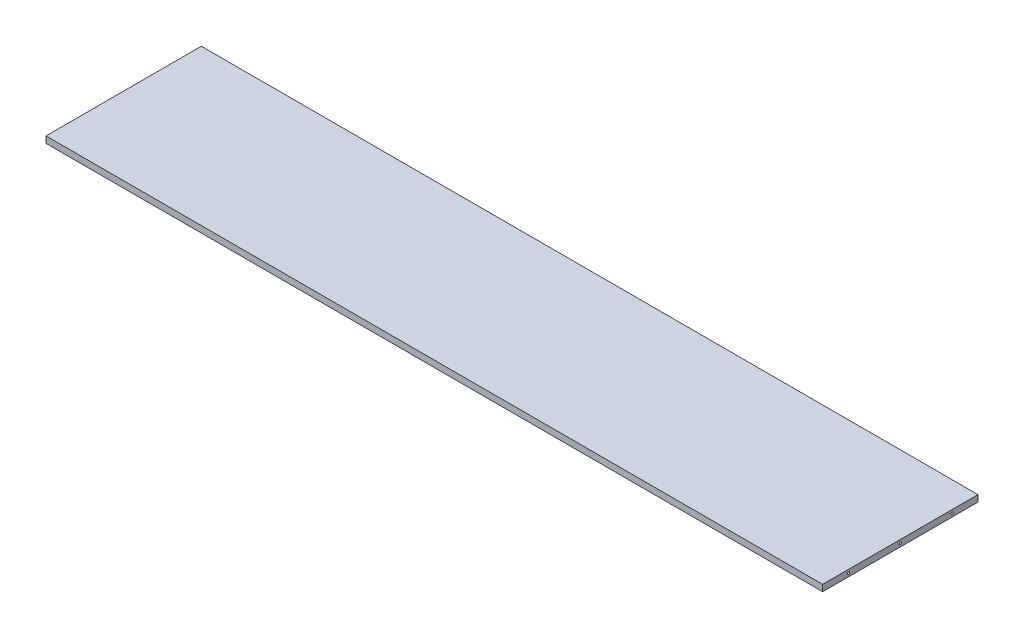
from build123d import *

# Parameters (mm, degrees)
SKETCH1_W                 = 762
SKETCH1_H                 = 152.4
BOSS_EXTRUDE1_DEPTH       = 6.35
F_4_40_TAPPED_HOLE1_D     = 2.2606
F_4_40_TAPPED_HOLE1_DEPTH = 7.5946
F_4_40_TAPPED_HOLE1_TIP   = 0.679152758
F_4_40_TAPPED_HOLE2_D     = 2.2606
F_4_40_TAPPED_HOLE2_DEPTH = 7.5946
F_4_40_TAPPED_HOLE2_TIP   = 0.679152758


with BuildPart() as part:
    # Sketch1 → Boss-Extrude1 (new body)
    with BuildSketch(Plane(origin=(0, 0, 0), x_dir=(1, 0, 0), z_dir=(0, 1, 0))):
        Rectangle(SKETCH1_W, SKETCH1_H)
    extrude(amount=BOSS_EXTRUDE1_DEPTH)

    # 4-40 Tapped Hole1
    with Locations(Plane(origin=(381, 0, 0), x_dir=(0, 0, -1), z_dir=(1, 0, 0))):
        with Locations((0, 3.175), (50.8, 3.175), (-50.8, 3.175)):
            Hole(F_4_40_TAPPED_HOLE1_D / 2, depth=F_4_40_TAPPED_HOLE1_DEPTH)
            with Locations((0, 0, -(F_4_40_TAPPED_HOLE1_DEPTH + F_4_40_TAPPED_HOLE1_TIP / 2))):  # 118° drill point
                Cone(0, F_4_40_TAPPED_HOLE1_D / 2, F_4_40_TAPPED_HOLE1_TIP, mode=Mode.SUBTRACT)

    # 4-40 Tapped Hole2
    with Locations(Plane.ZY.offset(381)):
        with Locations((0, 3.175), (50.8, 3.175), (-50.8, 3.175)):
            Hole(F_4_40_TAPPED_HOLE2_D / 2, depth=F_4_40_TAPPED_HOLE2_DEPTH)
            with Locations((0, 0, -(F_4_40_TAPPED_HOLE2_DEPTH + F_4_40_TAPPED_HOLE2_TIP / 2))):  # 118° drill point
                Cone(0, F_4_40_TAPPED_HOLE2_D / 2, F_4_40_TAPPED_HOLE2_TIP, mode=Mode.SUBTRACT)


solid = part.part
